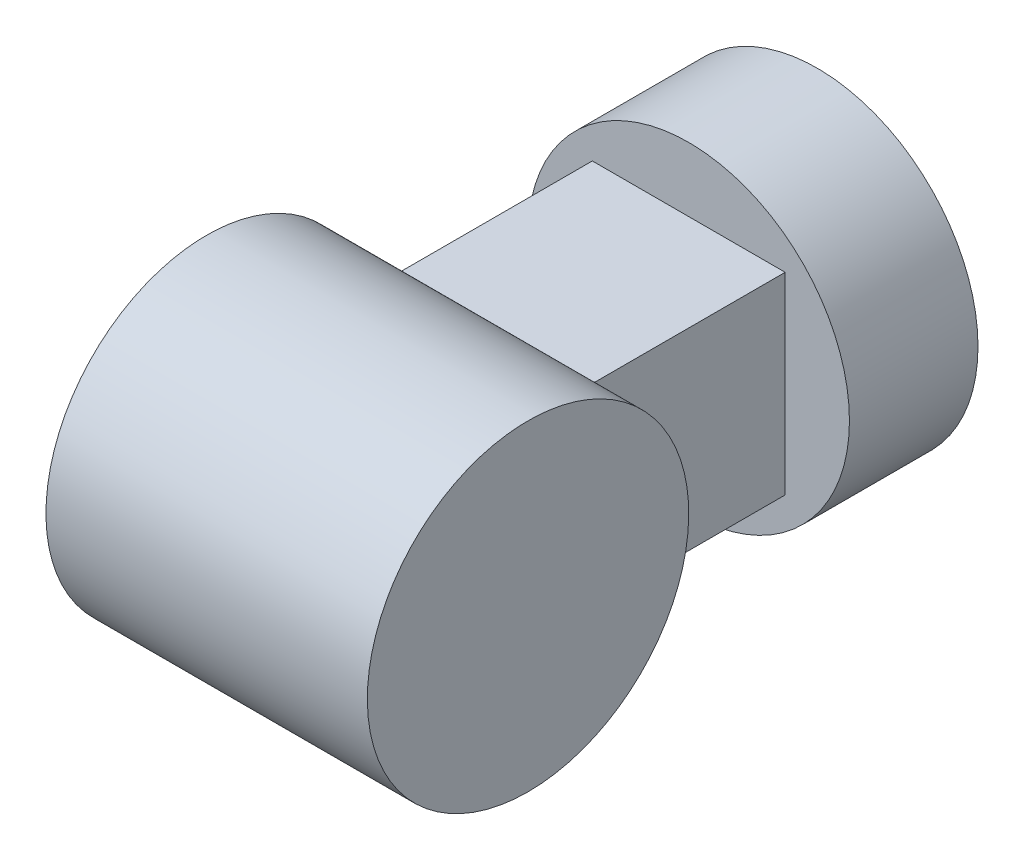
from build123d import *

# Parameters (mm, degrees)
ESQUISSE1_R             = 125
BOSS_EXTRU_2_DEPTH      = 100
ESQUISSE3_W             = 150
ESQUISSE3_H             = 150
BOSS_EXTRU_3_DEPTH      = 250
BOSS_EXTRU_6_DEPTH      = 50
BOSS_EXTRU_6_DEPTH_BACK = 200
ESQUISSE4_R             = 125


with BuildPart() as part:
    # Esquisse1 → Boss.-Extru.2 (new body)
    with BuildSketch(Plane.XY):
        Circle(ESQUISSE1_R)
    extrude(amount=BOSS_EXTRU_2_DEPTH)

    # Esquisse3 → Boss.-Extru.3 (add)
    with BuildSketch(Plane.XY.offset(100)):
        Rectangle(ESQUISSE3_W, ESQUISSE3_H)
    extrude(amount=BOSS_EXTRU_3_DEPTH)

    # Esquisse4 → Boss.-Extru.6 (add, two sides: drawn at the far end of the back side and taken through both)
    with BuildSketch(Plane.ZY.offset(75).offset(-BOSS_EXTRU_6_DEPTH_BACK)):
        with Locations(Location((350, 0, 0), (0, 0, 270))):
            Circle(ESQUISSE4_R)
    extrude(amount=BOSS_EXTRU_6_DEPTH + BOSS_EXTRU_6_DEPTH_BACK)


solid = part.part
